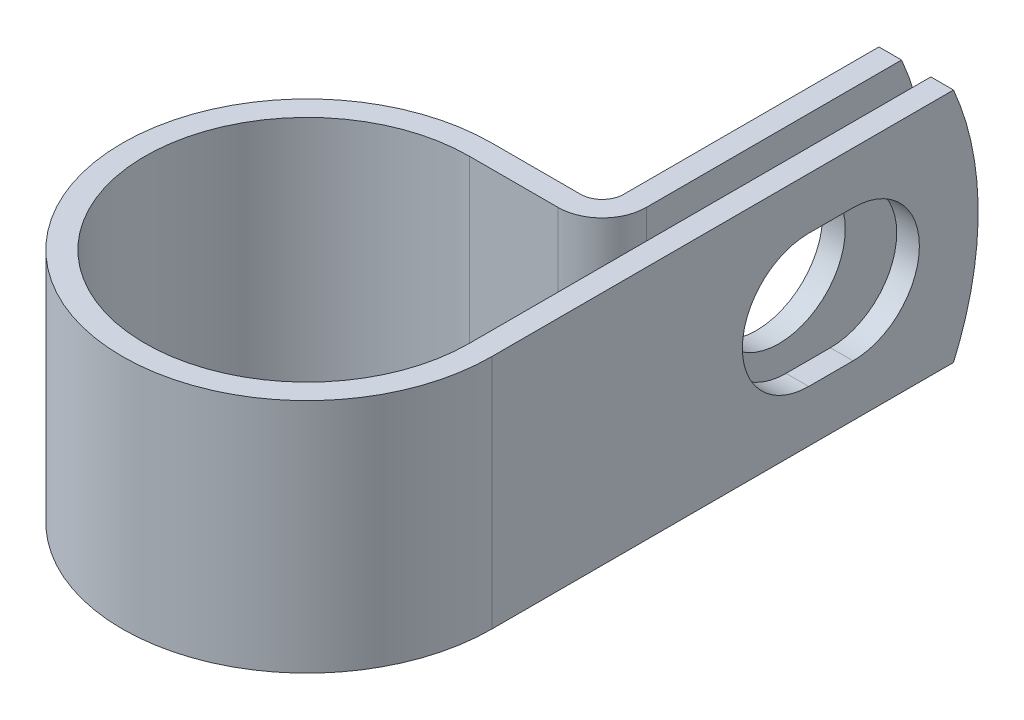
ISO-10303-21;
HEADER;
FILE_DESCRIPTION(('STEP AP214'),'2;1');
FILE_NAME('part.step','',(''),(''),'','','');
FILE_SCHEMA(('AUTOMOTIVE_DESIGN { 1 0 10303 214 1 1 1 1 }'));
ENDSEC;
DATA;
#1=APPLICATION_CONTEXT('core data for automotive mechanical design processes');
#2=APPLICATION_PROTOCOL_DEFINITION('international standard','automotive_design',2000,#1);
#3=PRODUCT_CONTEXT('',#1,'mechanical');
#4=PRODUCT('Part','Part','',(#3));
#5=PRODUCT_RELATED_PRODUCT_CATEGORY('part','',(#4));
#6=PRODUCT_DEFINITION_FORMATION('','',#4);
#7=PRODUCT_DEFINITION_CONTEXT('part definition',#1,'design');
#8=PRODUCT_DEFINITION('design','',#6,#7);
#9=PRODUCT_DEFINITION_SHAPE('','',#8);
#10=(LENGTH_UNIT() NAMED_UNIT(*) SI_UNIT(.MILLI.,.METRE.));
#11=(NAMED_UNIT(*) PLANE_ANGLE_UNIT() SI_UNIT($,.RADIAN.));
#12=(NAMED_UNIT(*) SI_UNIT($,.STERADIAN.) SOLID_ANGLE_UNIT());
#13=UNCERTAINTY_MEASURE_WITH_UNIT(LENGTH_MEASURE(1.E-05),#10,'distance_accuracy_value','');
#14=(GEOMETRIC_REPRESENTATION_CONTEXT(3) GLOBAL_UNCERTAINTY_ASSIGNED_CONTEXT((#13)) GLOBAL_UNIT_ASSIGNED_CONTEXT((#10,
#11,#12)) REPRESENTATION_CONTEXT('',''));
#15=CARTESIAN_POINT('',(0.,0.,0.));
#16=DIRECTION('',(0.,0.,1.));
#17=DIRECTION('',(1.,0.,0.));
#18=AXIS2_PLACEMENT_3D('',#15,#16,#17);
#19=CARTESIAN_POINT('',(8.7249,6.35,0.));
#20=DIRECTION('',(-1.,0.,0.));
#21=DIRECTION('',(0.,0.,1.));
#22=AXIS2_PLACEMENT_3D('',#19,#20,#21);
#23=PLANE('',#22);
#24=DIRECTION('',(0.,0.,-1.));
#25=VECTOR('',#24,1.);
#26=CARTESIAN_POINT('',(8.7249,-3.5687,-17.0433999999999));
#27=LINE('',#26,#25);
#28=CARTESIAN_POINT('',(8.7249,-3.5687,-17.0433999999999));
#29=VERTEX_POINT('',#28);
#30=CARTESIAN_POINT('',(8.7249,-3.5687,-19.4310000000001));
#31=VERTEX_POINT('',#30);
#32=EDGE_CURVE('E236',#29,#31,#27,.T.);
#33=ORIENTED_EDGE('',*,*,#32,.T.);
#34=CARTESIAN_POINT('',(8.7249,0.,-19.4309999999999));
#35=DIRECTION('',(-1.,0.,0.));
#36=DIRECTION('',(0.,0.,1.));
#37=AXIS2_PLACEMENT_3D('',#34,#35,#36);
#38=CIRCLE('',#37,3.5687);
#39=CARTESIAN_POINT('',(8.7249,3.5687,-19.4310000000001));
#40=VERTEX_POINT('',#39);
#41=EDGE_CURVE('E257',#31,#40,#38,.F.);
#42=ORIENTED_EDGE('',*,*,#41,.T.);
#43=DIRECTION('',(0.,0.,1.));
#44=VECTOR('',#43,1.);
#45=CARTESIAN_POINT('',(8.7249,3.5687,-17.0433999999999));
#46=LINE('',#45,#44);
#47=CARTESIAN_POINT('',(8.7249,3.5687,-17.0433999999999));
#48=VERTEX_POINT('',#47);
#49=EDGE_CURVE('E253',#40,#48,#46,.T.);
#50=ORIENTED_EDGE('',*,*,#49,.T.);
#51=CARTESIAN_POINT('',(8.7249,0.,-17.0433999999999));
#52=DIRECTION('',(-1.,0.,0.));
#53=DIRECTION('',(0.,0.,1.));
#54=AXIS2_PLACEMENT_3D('',#51,#52,#53);
#55=CIRCLE('',#54,3.5687);
#56=EDGE_CURVE('E248',#48,#29,#55,.F.);
#57=ORIENTED_EDGE('',*,*,#56,.T.);
#58=EDGE_LOOP('',(#33,#42,#50,#57));
#59=FACE_BOUND('',#58,.T.);
#60=CARTESIAN_POINT('',(8.7249,0.,-10.287));
#61=DIRECTION('',(-1.,0.,0.));
#62=DIRECTION('',(0.,0.,1.));
#63=AXIS2_PLACEMENT_3D('',#60,#61,#62);
#64=CIRCLE('',#63,15.875);
#65=CARTESIAN_POINT('',(8.7249,6.35,-24.8366778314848));
#66=VERTEX_POINT('',#65);
#67=CARTESIAN_POINT('',(8.7249,-6.35,-24.8366778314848));
#68=VERTEX_POINT('',#67);
#69=EDGE_CURVE('E75',#66,#68,#64,.T.);
#70=ORIENTED_EDGE('',*,*,#69,.T.);
#71=DIRECTION('',(0.,0.,-1.));
#72=VECTOR('',#71,1.);
#73=CARTESIAN_POINT('',(8.7249,-6.35,0.));
#74=LINE('',#73,#72);
#75=CARTESIAN_POINT('',(8.7249,-6.35,0.));
#76=VERTEX_POINT('',#75);
#77=EDGE_CURVE('E271',#76,#68,#74,.T.);
#78=ORIENTED_EDGE('',*,*,#77,.F.);
#79=DIRECTION('',(0.,-1.,0.));
#80=VECTOR('',#79,1.);
#81=CARTESIAN_POINT('',(8.7249,6.35,0.));
#82=LINE('',#81,#80);
#83=CARTESIAN_POINT('',(8.7249,6.35,0.));
#84=VERTEX_POINT('',#83);
#85=EDGE_CURVE('E218',#84,#76,#82,.T.);
#86=ORIENTED_EDGE('',*,*,#85,.F.);
#87=DIRECTION('',(0.,0.,-1.));
#88=VECTOR('',#87,1.);
#89=CARTESIAN_POINT('',(8.7249,6.35,-8.7249));
#90=LINE('',#89,#88);
#91=EDGE_CURVE('E273',#84,#66,#90,.T.);
#92=ORIENTED_EDGE('',*,*,#91,.T.);
#93=EDGE_LOOP('',(#70,#78,#86,#92));
#94=FACE_BOUND('',#93,.T.);
#95=ADVANCED_FACE('F54',(#59,#94),#23,.T.);
#96=CARTESIAN_POINT('',(7.1501,6.35,-26.162));
#97=DIRECTION('',(1.,0.,0.));
#98=DIRECTION('',(0.,0.,-1.));
#99=AXIS2_PLACEMENT_3D('',#96,#97,#98);
#100=PLANE('',#99);
#101=CARTESIAN_POINT('',(7.1501,0.,-18.2372));
#102=DIRECTION('',(1.,0.,0.));
#103=DIRECTION('',(0.,0.,-1.));
#104=AXIS2_PLACEMENT_3D('',#101,#102,#103);
#105=CIRCLE('',#104,3.5687);
#106=CARTESIAN_POINT('',(7.1501,0.,-21.8059));
#107=VERTEX_POINT('',#106);
#108=EDGE_CURVE('E268',#107,#107,#105,.F.);
#109=ORIENTED_EDGE('',*,*,#108,.T.);
#110=EDGE_LOOP('',(#109));
#111=FACE_BOUND('',#110,.T.);
#112=DIRECTION('',(0.,0.,1.));
#113=VECTOR('',#112,1.);
#114=CARTESIAN_POINT('',(7.1501,-6.35,-26.162));
#115=LINE('',#114,#113);
#116=CARTESIAN_POINT('',(7.1501,-6.35,-24.8366778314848));
#117=VERTEX_POINT('',#116);
#118=CARTESIAN_POINT('',(7.1501,-6.35,-11.10234));
#119=VERTEX_POINT('',#118);
#120=EDGE_CURVE('E184',#117,#119,#115,.T.);
#121=ORIENTED_EDGE('',*,*,#120,.F.);
#122=CARTESIAN_POINT('',(7.15010000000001,0.,-10.287));
#123=DIRECTION('',(1.,0.,0.));
#124=DIRECTION('',(0.,0.,-1.));
#125=AXIS2_PLACEMENT_3D('',#122,#123,#124);
#126=CIRCLE('',#125,15.875);
#127=CARTESIAN_POINT('',(7.1501,6.35,-24.8366778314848));
#128=VERTEX_POINT('',#127);
#129=EDGE_CURVE('E176',#117,#128,#126,.T.);
#130=ORIENTED_EDGE('',*,*,#129,.T.);
#131=DIRECTION('',(0.,0.,1.));
#132=VECTOR('',#131,1.);
#133=CARTESIAN_POINT('',(7.1501,6.35,-26.162));
#134=LINE('',#133,#132);
#135=CARTESIAN_POINT('',(7.1501,6.35,-11.10234));
#136=VERTEX_POINT('',#135);
#137=EDGE_CURVE('E224',#128,#136,#134,.T.);
#138=ORIENTED_EDGE('',*,*,#137,.T.);
#139=DIRECTION('',(0.,-1.,0.));
#140=VECTOR('',#139,1.);
#141=CARTESIAN_POINT('',(7.1501,6.35,-11.10234));
#142=LINE('',#141,#140);
#143=EDGE_CURVE('E211',#136,#119,#142,.T.);
#144=ORIENTED_EDGE('',*,*,#143,.T.);
#145=EDGE_LOOP('',(#121,#130,#138,#144));
#146=FACE_BOUND('',#145,.T.);
#147=ADVANCED_FACE('F226',(#111,#146),#100,.T.);
#148=CARTESIAN_POINT('',(5.9309,6.35,-26.162));
#149=DIRECTION('',(1.,0.,0.));
#150=DIRECTION('',(0.,0.,-1.));
#151=AXIS2_PLACEMENT_3D('',#148,#149,#150);
#152=PLANE('',#151);
#153=CARTESIAN_POINT('',(5.93090000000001,0.,-18.2372));
#154=DIRECTION('',(-1.,0.,0.));
#155=DIRECTION('',(0.,0.,1.));
#156=AXIS2_PLACEMENT_3D('',#153,#154,#155);
#157=CIRCLE('',#156,3.5687);
#158=CARTESIAN_POINT('',(5.93090000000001,0.,-14.6685));
#159=VERTEX_POINT('',#158);
#160=EDGE_CURVE('E265',#159,#159,#157,.T.);
#161=ORIENTED_EDGE('',*,*,#160,.F.);
#162=EDGE_LOOP('',(#161));
#163=FACE_BOUND('',#162,.T.);
#164=CARTESIAN_POINT('',(5.93090000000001,0.,-10.287));
#165=DIRECTION('',(-1.,0.,0.));
#166=DIRECTION('',(0.,0.,1.));
#167=AXIS2_PLACEMENT_3D('',#164,#165,#166);
#168=CIRCLE('',#167,15.875);
#169=CARTESIAN_POINT('',(5.9309,6.35,-24.8366778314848));
#170=VERTEX_POINT('',#169);
#171=CARTESIAN_POINT('',(5.93090000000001,-6.35,-24.8366778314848));
#172=VERTEX_POINT('',#171);
#173=EDGE_CURVE('E67',#170,#172,#168,.T.);
#174=ORIENTED_EDGE('',*,*,#173,.T.);
#175=DIRECTION('',(0.,0.,1.));
#176=VECTOR('',#175,1.);
#177=CARTESIAN_POINT('',(5.9309,-6.35,-26.162));
#178=LINE('',#177,#176);
#179=CARTESIAN_POINT('',(5.93090000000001,-6.35,-11.10234));
#180=VERTEX_POINT('',#179);
#181=EDGE_CURVE('E167',#172,#180,#178,.T.);
#182=ORIENTED_EDGE('',*,*,#181,.T.);
#183=DIRECTION('',(0.,-1.,0.));
#184=VECTOR('',#183,1.);
#185=CARTESIAN_POINT('',(5.93090000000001,6.35,-11.10234));
#186=LINE('',#185,#184);
#187=CARTESIAN_POINT('',(5.93090000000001,6.35,-11.10234));
#188=VERTEX_POINT('',#187);
#189=EDGE_CURVE('E209',#188,#180,#186,.T.);
#190=ORIENTED_EDGE('',*,*,#189,.F.);
#191=DIRECTION('',(0.,0.,1.));
#192=VECTOR('',#191,1.);
#193=CARTESIAN_POINT('',(5.9309,6.35,-26.162));
#194=LINE('',#193,#192);
#195=EDGE_CURVE('E169',#170,#188,#194,.T.);
#196=ORIENTED_EDGE('',*,*,#195,.F.);
#197=EDGE_LOOP('',(#174,#182,#190,#196));
#198=FACE_BOUND('',#197,.T.);
#199=ADVANCED_FACE('F164',(#163,#198),#152,.F.);
#200=CARTESIAN_POINT('',(9.9441,6.35,0.));
#201=DIRECTION('',(-1.,0.,0.));
#202=DIRECTION('',(0.,0.,1.));
#203=AXIS2_PLACEMENT_3D('',#200,#201,#202);
#204=PLANE('',#203);
#205=CARTESIAN_POINT('',(9.9441,0.,-19.4309999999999));
#206=DIRECTION('',(1.,0.,0.));
#207=DIRECTION('',(0.,0.,-1.));
#208=AXIS2_PLACEMENT_3D('',#205,#206,#207);
#209=CIRCLE('',#208,3.5687);
#210=CARTESIAN_POINT('',(9.9441,-3.5687,-19.4310000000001));
#211=VERTEX_POINT('',#210);
#212=CARTESIAN_POINT('',(9.9441,3.5687,-19.4310000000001));
#213=VERTEX_POINT('',#212);
#214=EDGE_CURVE('E237',#211,#213,#209,.T.);
#215=ORIENTED_EDGE('',*,*,#214,.F.);
#216=DIRECTION('',(0.,0.,-1.));
#217=VECTOR('',#216,1.);
#218=CARTESIAN_POINT('',(9.9441,-3.5687,-17.0433999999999));
#219=LINE('',#218,#217);
#220=CARTESIAN_POINT('',(9.9441,-3.5687,-17.0433999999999));
#221=VERTEX_POINT('',#220);
#222=EDGE_CURVE('E240',#221,#211,#219,.T.);
#223=ORIENTED_EDGE('',*,*,#222,.F.);
#224=CARTESIAN_POINT('',(9.9441,0.,-17.0433999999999));
#225=DIRECTION('',(1.,0.,0.));
#226=DIRECTION('',(0.,0.,-1.));
#227=AXIS2_PLACEMENT_3D('',#224,#225,#226);
#228=CIRCLE('',#227,3.5687);
#229=CARTESIAN_POINT('',(9.9441,3.5687,-17.0433999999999));
#230=VERTEX_POINT('',#229);
#231=EDGE_CURVE('E230',#230,#221,#228,.T.);
#232=ORIENTED_EDGE('',*,*,#231,.F.);
#233=DIRECTION('',(0.,0.,1.));
#234=VECTOR('',#233,1.);
#235=CARTESIAN_POINT('',(9.9441,3.5687,-17.0433999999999));
#236=LINE('',#235,#234);
#237=EDGE_CURVE('E234',#213,#230,#236,.T.);
#238=ORIENTED_EDGE('',*,*,#237,.F.);
#239=EDGE_LOOP('',(#215,#223,#232,#238));
#240=FACE_BOUND('',#239,.T.);
#241=DIRECTION('',(0.,0.,-1.));
#242=VECTOR('',#241,1.);
#243=CARTESIAN_POINT('',(9.9441,-6.35,0.));
#244=LINE('',#243,#242);
#245=CARTESIAN_POINT('',(9.9441,-6.35,0.));
#246=VERTEX_POINT('',#245);
#247=CARTESIAN_POINT('',(9.9441,-6.35,-24.8366778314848));
#248=VERTEX_POINT('',#247);
#249=EDGE_CURVE('E195',#246,#248,#244,.T.);
#250=ORIENTED_EDGE('',*,*,#249,.T.);
#251=CARTESIAN_POINT('',(9.9441,0.,-10.287));
#252=DIRECTION('',(-1.,0.,0.));
#253=DIRECTION('',(0.,0.,1.));
#254=AXIS2_PLACEMENT_3D('',#251,#252,#253);
#255=CIRCLE('',#254,15.875);
#256=CARTESIAN_POINT('',(9.9441,6.35,-24.8366778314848));
#257=VERTEX_POINT('',#256);
#258=EDGE_CURVE('E170',#257,#248,#255,.T.);
#259=ORIENTED_EDGE('',*,*,#258,.F.);
#260=DIRECTION('',(0.,0.,-1.));
#261=VECTOR('',#260,1.);
#262=CARTESIAN_POINT('',(9.9441,6.35,-8.7249));
#263=LINE('',#262,#261);
#264=CARTESIAN_POINT('',(9.9441,6.35,0.));
#265=VERTEX_POINT('',#264);
#266=EDGE_CURVE('E198',#265,#257,#263,.T.);
#267=ORIENTED_EDGE('',*,*,#266,.F.);
#268=DIRECTION('',(0.,-1.,0.));
#269=VECTOR('',#268,1.);
#270=CARTESIAN_POINT('',(9.9441,6.35,0.));
#271=LINE('',#270,#269);
#272=EDGE_CURVE('E199',#265,#246,#271,.T.);
#273=ORIENTED_EDGE('',*,*,#272,.T.);
#274=EDGE_LOOP('',(#250,#259,#267,#273));
#275=FACE_BOUND('',#274,.T.);
#276=ADVANCED_FACE('F321',(#240,#275),#204,.F.);
#277=CARTESIAN_POINT('',(0.,-6.35,0.));
#278=DIRECTION('',(0.,1.,0.));
#279=DIRECTION('',(1.,0.,0.));
#280=AXIS2_PLACEMENT_3D('',#277,#278,#279);
#281=PLANE('',#280);
#282=DIRECTION('',(-1.,0.,0.));
#283=VECTOR('',#282,1.);
#284=CARTESIAN_POINT('',(9.9441,-6.35,-24.8366778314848));
#285=LINE('',#284,#283);
#286=EDGE_CURVE('E171',#248,#68,#285,.T.);
#287=ORIENTED_EDGE('',*,*,#286,.F.);
#288=ORIENTED_EDGE('',*,*,#249,.F.);
#289=CARTESIAN_POINT('',(0.,-6.35,0.));
#290=DIRECTION('',(0.,1.,0.));
#291=DIRECTION('',(1.,0.,0.));
#292=AXIS2_PLACEMENT_3D('',#289,#290,#291);
#293=CIRCLE('',#292,9.9441);
#294=CARTESIAN_POINT('',(0.,-6.35,-9.9441));
#295=VERTEX_POINT('',#294);
#296=EDGE_CURVE('E193',#295,#246,#293,.T.);
#297=ORIENTED_EDGE('',*,*,#296,.F.);
#298=DIRECTION('',(-1.,0.,0.));
#299=VECTOR('',#298,1.);
#300=CARTESIAN_POINT('',(0.,-6.35,-9.9441));
#301=LINE('',#300,#299);
#302=CARTESIAN_POINT('',(4.77266,-6.35,-9.9441));
#303=VERTEX_POINT('',#302);
#304=EDGE_CURVE('E186',#303,#295,#301,.T.);
#305=ORIENTED_EDGE('',*,*,#304,.F.);
#306=CARTESIAN_POINT('',(4.77266,-6.35,-11.10234));
#307=DIRECTION('',(0.,1.,0.));
#308=DIRECTION('',(1.,0.,0.));
#309=AXIS2_PLACEMENT_3D('',#306,#307,#308);
#310=CIRCLE('',#309,1.15824);
#311=EDGE_CURVE('E183',#180,#303,#310,.F.);
#312=ORIENTED_EDGE('',*,*,#311,.F.);
#313=ORIENTED_EDGE('',*,*,#181,.F.);
#314=DIRECTION('',(-1.,0.,0.));
#315=VECTOR('',#314,1.);
#316=CARTESIAN_POINT('',(9.9441,-6.35,-24.8366778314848));
#317=LINE('',#316,#315);
#318=EDGE_CURVE('E12',#117,#172,#317,.T.);
#319=ORIENTED_EDGE('',*,*,#318,.F.);
#320=ORIENTED_EDGE('',*,*,#120,.T.);
#321=CARTESIAN_POINT('',(4.77266,-6.35,-11.10234));
#322=DIRECTION('',(0.,-1.,0.));
#323=DIRECTION('',(0.,0.,1.));
#324=AXIS2_PLACEMENT_3D('',#321,#322,#323);
#325=CIRCLE('',#324,2.37744);
#326=CARTESIAN_POINT('',(4.77266,-6.35,-8.7249));
#327=VERTEX_POINT('',#326);
#328=EDGE_CURVE('E188',#119,#327,#325,.T.);
#329=ORIENTED_EDGE('',*,*,#328,.T.);
#330=DIRECTION('',(-1.,0.,0.));
#331=VECTOR('',#330,1.);
#332=CARTESIAN_POINT('',(0.,-6.35,-8.7249));
#333=LINE('',#332,#331);
#334=CARTESIAN_POINT('',(0.,-6.35,-8.7249));
#335=VERTEX_POINT('',#334);
#336=EDGE_CURVE('E298',#327,#335,#333,.T.);
#337=ORIENTED_EDGE('',*,*,#336,.T.);
#338=CARTESIAN_POINT('',(0.,-6.35,0.));
#339=DIRECTION('',(0.,1.,0.));
#340=DIRECTION('',(0.,0.,1.));
#341=AXIS2_PLACEMENT_3D('',#338,#339,#340);
#342=CIRCLE('',#341,8.7249);
#343=EDGE_CURVE('E295',#335,#76,#342,.T.);
#344=ORIENTED_EDGE('',*,*,#343,.T.);
#345=ORIENTED_EDGE('',*,*,#77,.T.);
#346=EDGE_LOOP('',(#287,#288,#297,#305,#312,#313,#319,#320,#329,#337,#344,#345));
#347=FACE_BOUND('',#346,.T.);
#348=ADVANCED_FACE('F181',(#347),#281,.F.);
#349=CARTESIAN_POINT('',(0.,6.35,0.));
#350=DIRECTION('',(0.,1.,0.));
#351=DIRECTION('',(1.,0.,0.));
#352=AXIS2_PLACEMENT_3D('',#349,#350,#351);
#353=PLANE('',#352);
#354=ORIENTED_EDGE('',*,*,#266,.T.);
#355=DIRECTION('',(-1.,0.,0.));
#356=VECTOR('',#355,1.);
#357=CARTESIAN_POINT('',(9.9441,6.35,-24.8366778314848));
#358=LINE('',#357,#356);
#359=EDGE_CURVE('E228',#257,#66,#358,.T.);
#360=ORIENTED_EDGE('',*,*,#359,.T.);
#361=ORIENTED_EDGE('',*,*,#91,.F.);
#362=CARTESIAN_POINT('',(0.,6.35,0.));
#363=DIRECTION('',(0.,1.,0.));
#364=DIRECTION('',(0.,0.,1.));
#365=AXIS2_PLACEMENT_3D('',#362,#363,#364);
#366=CIRCLE('',#365,8.7249);
#367=CARTESIAN_POINT('',(0.,6.35,-8.7249));
#368=VERTEX_POINT('',#367);
#369=EDGE_CURVE('E276',#368,#84,#366,.T.);
#370=ORIENTED_EDGE('',*,*,#369,.F.);
#371=DIRECTION('',(-1.,0.,0.));
#372=VECTOR('',#371,1.);
#373=CARTESIAN_POINT('',(0.,6.35,-8.7249));
#374=LINE('',#373,#372);
#375=CARTESIAN_POINT('',(4.77266,6.35,-8.7249));
#376=VERTEX_POINT('',#375);
#377=EDGE_CURVE('E279',#376,#368,#374,.T.);
#378=ORIENTED_EDGE('',*,*,#377,.F.);
#379=CARTESIAN_POINT('',(4.77266,6.35,-11.10234));
#380=DIRECTION('',(0.,-1.,0.));
#381=DIRECTION('',(0.,0.,1.));
#382=AXIS2_PLACEMENT_3D('',#379,#380,#381);
#383=CIRCLE('',#382,2.37744);
#384=EDGE_CURVE('E282',#136,#376,#383,.T.);
#385=ORIENTED_EDGE('',*,*,#384,.F.);
#386=ORIENTED_EDGE('',*,*,#137,.F.);
#387=DIRECTION('',(-1.,0.,0.));
#388=VECTOR('',#387,1.);
#389=CARTESIAN_POINT('',(9.9441,6.35,-24.8366778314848));
#390=LINE('',#389,#388);
#391=EDGE_CURVE('E61',#128,#170,#390,.T.);
#392=ORIENTED_EDGE('',*,*,#391,.T.);
#393=ORIENTED_EDGE('',*,*,#195,.T.);
#394=CARTESIAN_POINT('',(4.77266,6.35,-11.10234));
#395=DIRECTION('',(0.,1.,0.));
#396=DIRECTION('',(1.,0.,0.));
#397=AXIS2_PLACEMENT_3D('',#394,#395,#396);
#398=CIRCLE('',#397,1.15824);
#399=CARTESIAN_POINT('',(4.77266,6.35,-9.9441));
#400=VERTEX_POINT('',#399);
#401=EDGE_CURVE('E287',#188,#400,#398,.F.);
#402=ORIENTED_EDGE('',*,*,#401,.T.);
#403=DIRECTION('',(-1.,0.,0.));
#404=VECTOR('',#403,1.);
#405=CARTESIAN_POINT('',(0.,6.35,-9.9441));
#406=LINE('',#405,#404);
#407=CARTESIAN_POINT('',(0.,6.35,-9.9441));
#408=VERTEX_POINT('',#407);
#409=EDGE_CURVE('E289',#400,#408,#406,.T.);
#410=ORIENTED_EDGE('',*,*,#409,.T.);
#411=CARTESIAN_POINT('',(0.,6.35,0.));
#412=DIRECTION('',(0.,1.,0.));
#413=DIRECTION('',(1.,0.,0.));
#414=AXIS2_PLACEMENT_3D('',#411,#412,#413);
#415=CIRCLE('',#414,9.9441);
#416=EDGE_CURVE('E203',#408,#265,#415,.T.);
#417=ORIENTED_EDGE('',*,*,#416,.T.);
#418=EDGE_LOOP('',(#354,#360,#361,#370,#378,#385,#386,#392,#393,#402,#410,#417));
#419=FACE_BOUND('',#418,.T.);
#420=ADVANCED_FACE('F222',(#419),#353,.T.);
#421=CARTESIAN_POINT('',(0.,6.35,0.));
#422=DIRECTION('',(0.,-1.,0.));
#423=DIRECTION('',(0.,0.,-1.));
#424=AXIS2_PLACEMENT_3D('',#421,#422,#423);
#425=CYLINDRICAL_SURFACE('',#424,8.7249);
#426=ORIENTED_EDGE('',*,*,#343,.F.);
#427=DIRECTION('',(0.,-1.,0.));
#428=VECTOR('',#427,1.);
#429=CARTESIAN_POINT('',(0.,6.35,-8.7249));
#430=LINE('',#429,#428);
#431=EDGE_CURVE('E216',#368,#335,#430,.T.);
#432=ORIENTED_EDGE('',*,*,#431,.F.);
#433=ORIENTED_EDGE('',*,*,#369,.T.);
#434=ORIENTED_EDGE('',*,*,#85,.T.);
#435=EDGE_LOOP('',(#426,#432,#433,#434));
#436=FACE_BOUND('',#435,.T.);
#437=ADVANCED_FACE('F311',(#436),#425,.F.);
#438=CARTESIAN_POINT('',(0.,6.35,-8.7249));
#439=DIRECTION('',(0.,0.,1.));
#440=DIRECTION('',(1.,0.,0.));
#441=AXIS2_PLACEMENT_3D('',#438,#439,#440);
#442=PLANE('',#441);
#443=ORIENTED_EDGE('',*,*,#336,.F.);
#444=DIRECTION('',(0.,-1.,0.));
#445=VECTOR('',#444,1.);
#446=CARTESIAN_POINT('',(4.77266,6.35,-8.7249));
#447=LINE('',#446,#445);
#448=EDGE_CURVE('E214',#376,#327,#447,.T.);
#449=ORIENTED_EDGE('',*,*,#448,.F.);
#450=ORIENTED_EDGE('',*,*,#377,.T.);
#451=ORIENTED_EDGE('',*,*,#431,.T.);
#452=EDGE_LOOP('',(#443,#449,#450,#451));
#453=FACE_BOUND('',#452,.T.);
#454=ADVANCED_FACE('F307',(#453),#442,.T.);
#455=CARTESIAN_POINT('',(4.77266,6.35,-11.10234));
#456=DIRECTION('',(0.,-1.,0.));
#457=DIRECTION('',(0.,0.,-1.));
#458=AXIS2_PLACEMENT_3D('',#455,#456,#457);
#459=CYLINDRICAL_SURFACE('',#458,2.37744);
#460=ORIENTED_EDGE('',*,*,#328,.F.);
#461=ORIENTED_EDGE('',*,*,#143,.F.);
#462=ORIENTED_EDGE('',*,*,#384,.T.);
#463=ORIENTED_EDGE('',*,*,#448,.T.);
#464=EDGE_LOOP('',(#460,#461,#462,#463));
#465=FACE_BOUND('',#464,.T.);
#466=ADVANCED_FACE('F304',(#465),#459,.T.);
#467=CARTESIAN_POINT('',(4.77266,6.35,-11.10234));
#468=DIRECTION('',(0.,-1.,0.));
#469=DIRECTION('',(0.,0.,-1.));
#470=AXIS2_PLACEMENT_3D('',#467,#468,#469);
#471=CYLINDRICAL_SURFACE('',#470,1.15824);
#472=ORIENTED_EDGE('',*,*,#311,.T.);
#473=DIRECTION('',(0.,-1.,0.));
#474=VECTOR('',#473,1.);
#475=CARTESIAN_POINT('',(4.77266,6.35,-9.9441));
#476=LINE('',#475,#474);
#477=EDGE_CURVE('E206',#400,#303,#476,.T.);
#478=ORIENTED_EDGE('',*,*,#477,.F.);
#479=ORIENTED_EDGE('',*,*,#401,.F.);
#480=ORIENTED_EDGE('',*,*,#189,.T.);
#481=EDGE_LOOP('',(#472,#478,#479,#480));
#482=FACE_BOUND('',#481,.T.);
#483=ADVANCED_FACE('F334',(#482),#471,.F.);
#484=CARTESIAN_POINT('',(0.,6.35,-9.9441));
#485=DIRECTION('',(0.,0.,1.));
#486=DIRECTION('',(1.,0.,0.));
#487=AXIS2_PLACEMENT_3D('',#484,#485,#486);
#488=PLANE('',#487);
#489=ORIENTED_EDGE('',*,*,#304,.T.);
#490=DIRECTION('',(0.,-1.,0.));
#491=VECTOR('',#490,1.);
#492=CARTESIAN_POINT('',(0.,6.35,-9.9441));
#493=LINE('',#492,#491);
#494=EDGE_CURVE('E202',#408,#295,#493,.T.);
#495=ORIENTED_EDGE('',*,*,#494,.F.);
#496=ORIENTED_EDGE('',*,*,#409,.F.);
#497=ORIENTED_EDGE('',*,*,#477,.T.);
#498=EDGE_LOOP('',(#489,#495,#496,#497));
#499=FACE_BOUND('',#498,.T.);
#500=ADVANCED_FACE('F330',(#499),#488,.F.);
#501=CARTESIAN_POINT('',(0.,6.35,0.));
#502=DIRECTION('',(0.,-1.,0.));
#503=DIRECTION('',(0.,0.,-1.));
#504=AXIS2_PLACEMENT_3D('',#501,#502,#503);
#505=CYLINDRICAL_SURFACE('',#504,9.9441);
#506=ORIENTED_EDGE('',*,*,#296,.T.);
#507=ORIENTED_EDGE('',*,*,#272,.F.);
#508=ORIENTED_EDGE('',*,*,#416,.F.);
#509=ORIENTED_EDGE('',*,*,#494,.T.);
#510=EDGE_LOOP('',(#506,#507,#508,#509));
#511=FACE_BOUND('',#510,.T.);
#512=ADVANCED_FACE('F327',(#511),#505,.T.);
#513=CARTESIAN_POINT('',(17.2439078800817,0.,-18.2372));
#514=DIRECTION('',(-1.,0.,0.));
#515=DIRECTION('',(0.,0.,1.));
#516=AXIS2_PLACEMENT_3D('',#513,#514,#515);
#517=CYLINDRICAL_SURFACE('',#516,3.5687);
#518=ORIENTED_EDGE('',*,*,#160,.T.);
#519=EDGE_LOOP('',(#518));
#520=FACE_BOUND('',#519,.T.);
#521=ORIENTED_EDGE('',*,*,#108,.F.);
#522=EDGE_LOOP('',(#521));
#523=FACE_BOUND('',#522,.T.);
#524=ADVANCED_FACE('F379',(#520,#523),#517,.F.);
#525=CARTESIAN_POINT('',(-3.1775410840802,-3.5687,-17.0433999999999));
#526=DIRECTION('',(0.,-1.,0.));
#527=DIRECTION('',(0.,0.,-1.));
#528=AXIS2_PLACEMENT_3D('',#525,#526,#527);
#529=PLANE('',#528);
#530=DIRECTION('',(1.,0.,0.));
#531=VECTOR('',#530,1.);
#532=CARTESIAN_POINT('',(-3.1775410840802,-3.5687,-17.0433999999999));
#533=LINE('',#532,#531);
#534=EDGE_CURVE('E251',#29,#221,#533,.T.);
#535=ORIENTED_EDGE('',*,*,#534,.T.);
#536=ORIENTED_EDGE('',*,*,#222,.T.);
#537=DIRECTION('',(1.,0.,0.));
#538=VECTOR('',#537,1.);
#539=CARTESIAN_POINT('',(-3.1775410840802,-3.5687,-19.4310000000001));
#540=LINE('',#539,#538);
#541=EDGE_CURVE('E247',#31,#211,#540,.T.);
#542=ORIENTED_EDGE('',*,*,#541,.F.);
#543=ORIENTED_EDGE('',*,*,#32,.F.);
#544=EDGE_LOOP('',(#535,#536,#542,#543));
#545=FACE_BOUND('',#544,.T.);
#546=ADVANCED_FACE('F354',(#545),#529,.F.);
#547=CARTESIAN_POINT('',(-3.1775410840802,0.,-19.4309999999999));
#548=DIRECTION('',(1.,0.,0.));
#549=DIRECTION('',(0.,0.,-1.));
#550=AXIS2_PLACEMENT_3D('',#547,#548,#549);
#551=CYLINDRICAL_SURFACE('',#550,3.5687);
#552=ORIENTED_EDGE('',*,*,#541,.T.);
#553=ORIENTED_EDGE('',*,*,#214,.T.);
#554=DIRECTION('',(1.,0.,0.));
#555=VECTOR('',#554,1.);
#556=CARTESIAN_POINT('',(-3.1775410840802,3.5687,-19.4310000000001));
#557=LINE('',#556,#555);
#558=EDGE_CURVE('E256',#40,#213,#557,.T.);
#559=ORIENTED_EDGE('',*,*,#558,.F.);
#560=ORIENTED_EDGE('',*,*,#41,.F.);
#561=EDGE_LOOP('',(#552,#553,#559,#560));
#562=FACE_BOUND('',#561,.T.);
#563=ADVANCED_FACE('F358',(#562),#551,.F.);
#564=CARTESIAN_POINT('',(-3.1775410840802,3.5687,-17.0433999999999));
#565=DIRECTION('',(0.,1.,0.));
#566=DIRECTION('',(0.,0.,1.));
#567=AXIS2_PLACEMENT_3D('',#564,#565,#566);
#568=PLANE('',#567);
#569=ORIENTED_EDGE('',*,*,#558,.T.);
#570=ORIENTED_EDGE('',*,*,#237,.T.);
#571=DIRECTION('',(1.,0.,0.));
#572=VECTOR('',#571,1.);
#573=CARTESIAN_POINT('',(-3.1775410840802,3.5687,-17.0433999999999));
#574=LINE('',#573,#572);
#575=EDGE_CURVE('E252',#48,#230,#574,.T.);
#576=ORIENTED_EDGE('',*,*,#575,.F.);
#577=ORIENTED_EDGE('',*,*,#49,.F.);
#578=EDGE_LOOP('',(#569,#570,#576,#577));
#579=FACE_BOUND('',#578,.T.);
#580=ADVANCED_FACE('F362',(#579),#568,.F.);
#581=CARTESIAN_POINT('',(-3.1775410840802,0.,-17.0433999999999));
#582=DIRECTION('',(1.,0.,0.));
#583=DIRECTION('',(0.,0.,-1.));
#584=AXIS2_PLACEMENT_3D('',#581,#582,#583);
#585=CYLINDRICAL_SURFACE('',#584,3.5687);
#586=ORIENTED_EDGE('',*,*,#575,.T.);
#587=ORIENTED_EDGE('',*,*,#231,.T.);
#588=ORIENTED_EDGE('',*,*,#534,.F.);
#589=ORIENTED_EDGE('',*,*,#56,.F.);
#590=EDGE_LOOP('',(#586,#587,#588,#589));
#591=FACE_BOUND('',#590,.T.);
#592=ADVANCED_FACE('F366',(#591),#585,.F.);
#593=CARTESIAN_POINT('',(9.9441,0.,-10.287));
#594=DIRECTION('',(-1.,0.,0.));
#595=DIRECTION('',(0.,0.,1.));
#596=AXIS2_PLACEMENT_3D('',#593,#594,#595);
#597=CYLINDRICAL_SURFACE('',#596,15.875);
#598=ORIENTED_EDGE('',*,*,#129,.F.);
#599=ORIENTED_EDGE('',*,*,#318,.T.);
#600=ORIENTED_EDGE('',*,*,#173,.F.);
#601=ORIENTED_EDGE('',*,*,#391,.F.);
#602=EDGE_LOOP('',(#598,#599,#600,#601));
#603=FACE_BOUND('',#602,.T.);
#604=ADVANCED_FACE('F174',(#603),#597,.T.);
#605=ORIENTED_EDGE('',*,*,#359,.F.);
#606=ORIENTED_EDGE('',*,*,#258,.T.);
#607=ORIENTED_EDGE('',*,*,#286,.T.);
#608=ORIENTED_EDGE('',*,*,#69,.F.);
#609=EDGE_LOOP('',(#605,#606,#607,#608));
#610=FACE_BOUND('',#609,.T.);
#611=ADVANCED_FACE('F316',(#610),#597,.T.);
#612=CLOSED_SHELL('',(#95,#147,#199,#276,#348,#420,#437,#454,#466,#483,#500,#512,#524,#546,#563,
#580,#592,#604,#611));
#613=MANIFOLD_SOLID_BREP('B2',#612);
#614=ADVANCED_BREP_SHAPE_REPRESENTATION('',(#18,#613),#14);
#615=SHAPE_DEFINITION_REPRESENTATION(#9,#614);
ENDSEC;
END-ISO-10303-21;
